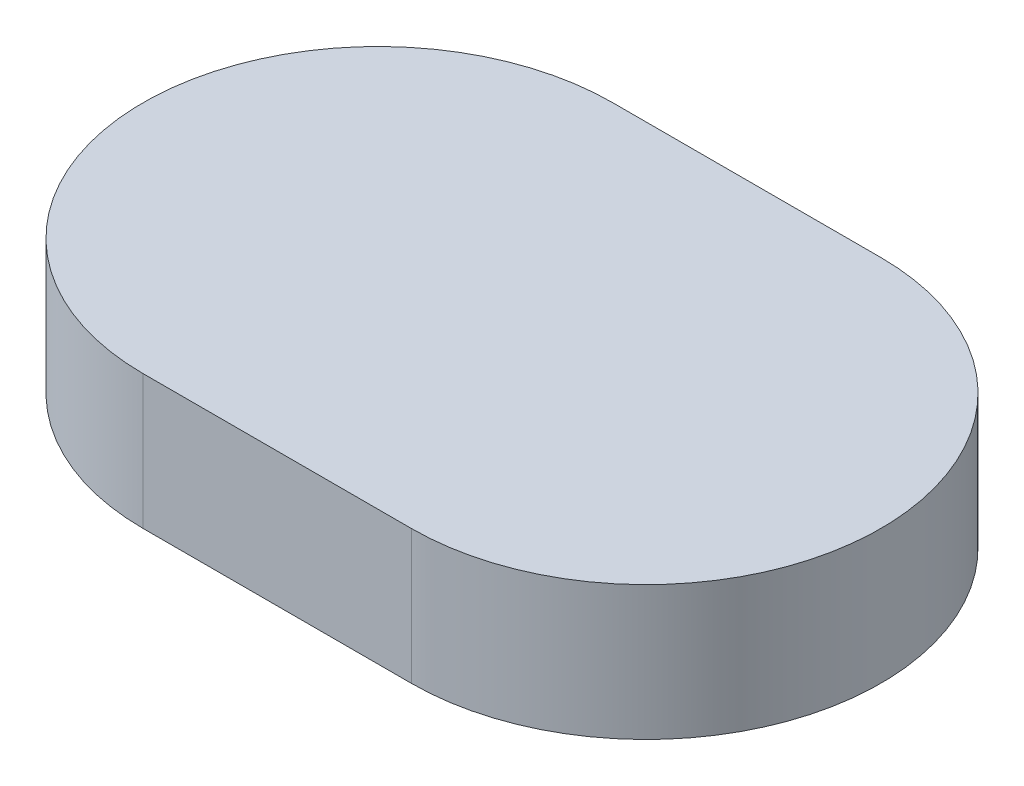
ISO-10303-21;
HEADER;
FILE_DESCRIPTION(('STEP AP214'),'2;1');
FILE_NAME('part.step','',(''),(''),'','','');
FILE_SCHEMA(('AUTOMOTIVE_DESIGN { 1 0 10303 214 1 1 1 1 }'));
ENDSEC;
DATA;
#1=APPLICATION_CONTEXT('core data for automotive mechanical design processes');
#2=APPLICATION_PROTOCOL_DEFINITION('international standard','automotive_design',2000,#1);
#3=PRODUCT_CONTEXT('',#1,'mechanical');
#4=PRODUCT('Part','Part','',(#3));
#5=PRODUCT_RELATED_PRODUCT_CATEGORY('part','',(#4));
#6=PRODUCT_DEFINITION_FORMATION('','',#4);
#7=PRODUCT_DEFINITION_CONTEXT('part definition',#1,'design');
#8=PRODUCT_DEFINITION('design','',#6,#7);
#9=PRODUCT_DEFINITION_SHAPE('','',#8);
#10=(LENGTH_UNIT() NAMED_UNIT(*) SI_UNIT(.MILLI.,.METRE.));
#11=(NAMED_UNIT(*) PLANE_ANGLE_UNIT() SI_UNIT($,.RADIAN.));
#12=(NAMED_UNIT(*) SI_UNIT($,.STERADIAN.) SOLID_ANGLE_UNIT());
#13=UNCERTAINTY_MEASURE_WITH_UNIT(LENGTH_MEASURE(1.E-05),#10,'distance_accuracy_value','');
#14=(GEOMETRIC_REPRESENTATION_CONTEXT(3) GLOBAL_UNCERTAINTY_ASSIGNED_CONTEXT((#13)) GLOBAL_UNIT_ASSIGNED_CONTEXT((#10,
#11,#12)) REPRESENTATION_CONTEXT('',''));
#15=CARTESIAN_POINT('',(0.,0.,0.));
#16=DIRECTION('',(0.,0.,1.));
#17=DIRECTION('',(1.,0.,0.));
#18=AXIS2_PLACEMENT_3D('',#15,#16,#17);
#19=CARTESIAN_POINT('',(-2.,2.,0.));
#20=DIRECTION('',(0.,-1.,0.));
#21=DIRECTION('',(0.,0.,-1.));
#22=AXIS2_PLACEMENT_3D('',#19,#20,#21);
#23=CYLINDRICAL_SURFACE('',#22,3.5);
#24=CARTESIAN_POINT('',(-2.,0.,0.));
#25=DIRECTION('',(0.,1.,0.));
#26=DIRECTION('',(0.,0.,1.));
#27=AXIS2_PLACEMENT_3D('',#24,#25,#26);
#28=CIRCLE('',#27,3.5);
#29=CARTESIAN_POINT('',(-2.,0.,-3.5));
#30=VERTEX_POINT('',#29);
#31=CARTESIAN_POINT('',(-2.,0.,3.5));
#32=VERTEX_POINT('',#31);
#33=EDGE_CURVE('E96',#30,#32,#28,.T.);
#34=ORIENTED_EDGE('',*,*,#33,.T.);
#35=DIRECTION('',(0.,-1.,0.));
#36=VECTOR('',#35,1.);
#37=CARTESIAN_POINT('',(-2.,2.,3.5));
#38=LINE('',#37,#36);
#39=CARTESIAN_POINT('',(-2.,2.,3.5));
#40=VERTEX_POINT('',#39);
#41=EDGE_CURVE('E11',#40,#32,#38,.T.);
#42=ORIENTED_EDGE('',*,*,#41,.F.);
#43=CARTESIAN_POINT('',(-2.,2.,0.));
#44=DIRECTION('',(0.,1.,0.));
#45=DIRECTION('',(0.,0.,1.));
#46=AXIS2_PLACEMENT_3D('',#43,#44,#45);
#47=CIRCLE('',#46,3.5);
#48=CARTESIAN_POINT('',(-2.,2.,-3.5));
#49=VERTEX_POINT('',#48);
#50=EDGE_CURVE('E84',#49,#40,#47,.T.);
#51=ORIENTED_EDGE('',*,*,#50,.F.);
#52=DIRECTION('',(0.,-1.,0.));
#53=VECTOR('',#52,1.);
#54=CARTESIAN_POINT('',(-2.,2.,-3.5));
#55=LINE('',#54,#53);
#56=EDGE_CURVE('E92',#49,#30,#55,.T.);
#57=ORIENTED_EDGE('',*,*,#56,.T.);
#58=EDGE_LOOP('',(#34,#42,#51,#57));
#59=FACE_BOUND('',#58,.T.);
#60=ADVANCED_FACE('F33',(#59),#23,.T.);
#61=CARTESIAN_POINT('',(-2.,2.,3.5));
#62=DIRECTION('',(0.,0.,-1.));
#63=DIRECTION('',(-1.,0.,0.));
#64=AXIS2_PLACEMENT_3D('',#61,#62,#63);
#65=PLANE('',#64);
#66=DIRECTION('',(1.,0.,0.));
#67=VECTOR('',#66,1.);
#68=CARTESIAN_POINT('',(-2.,0.,3.5));
#69=LINE('',#68,#67);
#70=CARTESIAN_POINT('',(2.,0.,3.5));
#71=VERTEX_POINT('',#70);
#72=EDGE_CURVE('E88',#32,#71,#69,.T.);
#73=ORIENTED_EDGE('',*,*,#72,.T.);
#74=DIRECTION('',(0.,-1.,0.));
#75=VECTOR('',#74,1.);
#76=CARTESIAN_POINT('',(2.,2.,3.5));
#77=LINE('',#76,#75);
#78=CARTESIAN_POINT('',(2.,2.,3.5));
#79=VERTEX_POINT('',#78);
#80=EDGE_CURVE('E41',#79,#71,#77,.T.);
#81=ORIENTED_EDGE('',*,*,#80,.F.);
#82=DIRECTION('',(1.,0.,0.));
#83=VECTOR('',#82,1.);
#84=CARTESIAN_POINT('',(-2.,2.,3.5));
#85=LINE('',#84,#83);
#86=EDGE_CURVE('E79',#40,#79,#85,.T.);
#87=ORIENTED_EDGE('',*,*,#86,.F.);
#88=ORIENTED_EDGE('',*,*,#41,.T.);
#89=EDGE_LOOP('',(#73,#81,#87,#88));
#90=FACE_BOUND('',#89,.T.);
#91=ADVANCED_FACE('F87',(#90),#65,.F.);
#92=CARTESIAN_POINT('',(2.,2.,0.));
#93=DIRECTION('',(0.,-1.,0.));
#94=DIRECTION('',(0.,0.,-1.));
#95=AXIS2_PLACEMENT_3D('',#92,#93,#94);
#96=CYLINDRICAL_SURFACE('',#95,3.5);
#97=CARTESIAN_POINT('',(2.,0.,0.));
#98=DIRECTION('',(0.,1.,0.));
#99=DIRECTION('',(0.,0.,1.));
#100=AXIS2_PLACEMENT_3D('',#97,#98,#99);
#101=CIRCLE('',#100,3.5);
#102=CARTESIAN_POINT('',(2.,0.,-3.5));
#103=VERTEX_POINT('',#102);
#104=EDGE_CURVE('E66',#71,#103,#101,.T.);
#105=ORIENTED_EDGE('',*,*,#104,.T.);
#106=DIRECTION('',(0.,-1.,0.));
#107=VECTOR('',#106,1.);
#108=CARTESIAN_POINT('',(2.,2.,-3.5));
#109=LINE('',#108,#107);
#110=CARTESIAN_POINT('',(2.,2.,-3.5));
#111=VERTEX_POINT('',#110);
#112=EDGE_CURVE('E89',#111,#103,#109,.T.);
#113=ORIENTED_EDGE('',*,*,#112,.F.);
#114=CARTESIAN_POINT('',(2.,2.,0.));
#115=DIRECTION('',(0.,1.,0.));
#116=DIRECTION('',(0.,0.,1.));
#117=AXIS2_PLACEMENT_3D('',#114,#115,#116);
#118=CIRCLE('',#117,3.5);
#119=EDGE_CURVE('E82',#79,#111,#118,.T.);
#120=ORIENTED_EDGE('',*,*,#119,.F.);
#121=ORIENTED_EDGE('',*,*,#80,.T.);
#122=EDGE_LOOP('',(#105,#113,#120,#121));
#123=FACE_BOUND('',#122,.T.);
#124=ADVANCED_FACE('F90',(#123),#96,.T.);
#125=CARTESIAN_POINT('',(-2.,2.,-3.5));
#126=DIRECTION('',(0.,0.,1.));
#127=DIRECTION('',(1.,0.,0.));
#128=AXIS2_PLACEMENT_3D('',#125,#126,#127);
#129=PLANE('',#128);
#130=DIRECTION('',(-1.,0.,0.));
#131=VECTOR('',#130,1.);
#132=CARTESIAN_POINT('',(-2.,0.,-3.5));
#133=LINE('',#132,#131);
#134=EDGE_CURVE('E72',#103,#30,#133,.T.);
#135=ORIENTED_EDGE('',*,*,#134,.T.);
#136=ORIENTED_EDGE('',*,*,#56,.F.);
#137=DIRECTION('',(-1.,0.,0.));
#138=VECTOR('',#137,1.);
#139=CARTESIAN_POINT('',(-2.,2.,-3.5));
#140=LINE('',#139,#138);
#141=EDGE_CURVE('E49',#111,#49,#140,.T.);
#142=ORIENTED_EDGE('',*,*,#141,.F.);
#143=ORIENTED_EDGE('',*,*,#112,.T.);
#144=EDGE_LOOP('',(#135,#136,#142,#143));
#145=FACE_BOUND('',#144,.T.);
#146=ADVANCED_FACE('F103',(#145),#129,.F.);
#147=CARTESIAN_POINT('',(-2.,2.,0.));
#148=DIRECTION('',(0.,1.,0.));
#149=DIRECTION('',(0.,0.,1.));
#150=AXIS2_PLACEMENT_3D('',#147,#148,#149);
#151=PLANE('',#150);
#152=ORIENTED_EDGE('',*,*,#50,.T.);
#153=ORIENTED_EDGE('',*,*,#86,.T.);
#154=ORIENTED_EDGE('',*,*,#119,.T.);
#155=ORIENTED_EDGE('',*,*,#141,.T.);
#156=EDGE_LOOP('',(#152,#153,#154,#155));
#157=FACE_BOUND('',#156,.T.);
#158=ADVANCED_FACE('F80',(#157),#151,.T.);
#159=CARTESIAN_POINT('',(-2.,0.,0.));
#160=DIRECTION('',(0.,1.,0.));
#161=DIRECTION('',(0.,0.,1.));
#162=AXIS2_PLACEMENT_3D('',#159,#160,#161);
#163=PLANE('',#162);
#164=ORIENTED_EDGE('',*,*,#33,.F.);
#165=ORIENTED_EDGE('',*,*,#134,.F.);
#166=ORIENTED_EDGE('',*,*,#104,.F.);
#167=ORIENTED_EDGE('',*,*,#72,.F.);
#168=EDGE_LOOP('',(#164,#165,#166,#167));
#169=FACE_BOUND('',#168,.T.);
#170=ADVANCED_FACE('F106',(#169),#163,.F.);
#171=CLOSED_SHELL('',(#60,#91,#124,#146,#158,#170));
#172=MANIFOLD_SOLID_BREP('B2',#171);
#173=ADVANCED_BREP_SHAPE_REPRESENTATION('',(#18,#172),#14);
#174=SHAPE_DEFINITION_REPRESENTATION(#9,#173);
ENDSEC;
END-ISO-10303-21;
